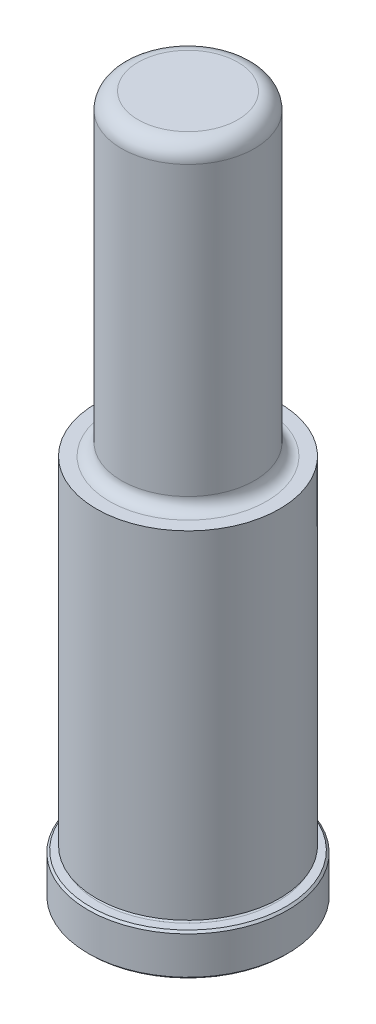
ISO-10303-21;
HEADER;
FILE_DESCRIPTION(('STEP AP214'),'2;1');
FILE_NAME('part.step','',(''),(''),'','','');
FILE_SCHEMA(('AUTOMOTIVE_DESIGN { 1 0 10303 214 1 1 1 1 }'));
ENDSEC;
DATA;
#1=APPLICATION_CONTEXT('core data for automotive mechanical design processes');
#2=APPLICATION_PROTOCOL_DEFINITION('international standard','automotive_design',2000,#1);
#3=PRODUCT_CONTEXT('',#1,'mechanical');
#4=PRODUCT('Part','Part','',(#3));
#5=PRODUCT_RELATED_PRODUCT_CATEGORY('part','',(#4));
#6=PRODUCT_DEFINITION_FORMATION('','',#4);
#7=PRODUCT_DEFINITION_CONTEXT('part definition',#1,'design');
#8=PRODUCT_DEFINITION('design','',#6,#7);
#9=PRODUCT_DEFINITION_SHAPE('','',#8);
#10=(LENGTH_UNIT() NAMED_UNIT(*) SI_UNIT(.MILLI.,.METRE.));
#11=(NAMED_UNIT(*) PLANE_ANGLE_UNIT() SI_UNIT($,.RADIAN.));
#12=(NAMED_UNIT(*) SI_UNIT($,.STERADIAN.) SOLID_ANGLE_UNIT());
#13=UNCERTAINTY_MEASURE_WITH_UNIT(LENGTH_MEASURE(1.E-05),#10,'distance_accuracy_value','');
#14=(GEOMETRIC_REPRESENTATION_CONTEXT(3) GLOBAL_UNCERTAINTY_ASSIGNED_CONTEXT((#13)) GLOBAL_UNIT_ASSIGNED_CONTEXT((#10,
#11,#12)) REPRESENTATION_CONTEXT('',''));
#15=CARTESIAN_POINT('',(0.,0.,0.));
#16=DIRECTION('',(0.,0.,1.));
#17=DIRECTION('',(1.,0.,0.));
#18=AXIS2_PLACEMENT_3D('',#15,#16,#17);
#19=CARTESIAN_POINT('',(0.,0.,0.));
#20=DIRECTION('',(0.,1.,0.));
#21=DIRECTION('',(0.,0.,1.));
#22=AXIS2_PLACEMENT_3D('',#19,#20,#21);
#23=PLANE('',#22);
#24=CARTESIAN_POINT('',(0.,0.,0.));
#25=DIRECTION('',(0.,1.,0.));
#26=DIRECTION('',(0.,0.,1.));
#27=AXIS2_PLACEMENT_3D('',#24,#25,#26);
#28=CIRCLE('',#27,18.669);
#29=CARTESIAN_POINT('',(0.,0.,18.669));
#30=VERTEX_POINT('',#29);
#31=EDGE_CURVE('E46',#30,#30,#28,.F.);
#32=ORIENTED_EDGE('',*,*,#31,.T.);
#33=EDGE_LOOP('',(#32));
#34=FACE_BOUND('',#33,.T.);
#35=ADVANCED_FACE('F31',(#34),#23,.F.);
#36=CARTESIAN_POINT('',(0.,0.,0.));
#37=DIRECTION('',(0.,1.,0.));
#38=DIRECTION('',(0.,0.,1.));
#39=AXIS2_PLACEMENT_3D('',#36,#37,#38);
#40=CYLINDRICAL_SURFACE('',#39,19.05);
#41=CARTESIAN_POINT('',(0.,0.380999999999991,0.));
#42=DIRECTION('',(0.,1.,0.));
#43=DIRECTION('',(0.,0.,1.));
#44=AXIS2_PLACEMENT_3D('',#41,#42,#43);
#45=CIRCLE('',#44,19.05);
#46=CARTESIAN_POINT('',(0.,0.380999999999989,19.05));
#47=VERTEX_POINT('',#46);
#48=EDGE_CURVE('E51',#47,#47,#45,.T.);
#49=ORIENTED_EDGE('',*,*,#48,.T.);
#50=EDGE_LOOP('',(#49));
#51=FACE_BOUND('',#50,.T.);
#52=CARTESIAN_POINT('',(0.,7.54380000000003,0.));
#53=DIRECTION('',(0.,-1.,0.));
#54=DIRECTION('',(0.,0.,-1.));
#55=AXIS2_PLACEMENT_3D('',#52,#53,#54);
#56=CIRCLE('',#55,19.05);
#57=CARTESIAN_POINT('',(0.,7.54380000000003,-19.05));
#58=VERTEX_POINT('',#57);
#59=EDGE_CURVE('E54',#58,#58,#56,.T.);
#60=ORIENTED_EDGE('',*,*,#59,.T.);
#61=EDGE_LOOP('',(#60));
#62=FACE_BOUND('',#61,.T.);
#63=ADVANCED_FACE('F110',(#51,#62),#40,.T.);
#64=CARTESIAN_POINT('',(0.,7.9248,-19.05));
#65=DIRECTION('',(0.,-1.,0.));
#66=DIRECTION('',(0.,0.,-1.));
#67=AXIS2_PLACEMENT_3D('',#64,#65,#66);
#68=PLANE('',#67);
#69=CARTESIAN_POINT('',(0.,7.9248,0.));
#70=DIRECTION('',(0.,-1.,0.));
#71=DIRECTION('',(0.,0.,-1.));
#72=AXIS2_PLACEMENT_3D('',#69,#70,#71);
#73=CIRCLE('',#72,18.669);
#74=CARTESIAN_POINT('',(0.,7.9248,-18.669));
#75=VERTEX_POINT('',#74);
#76=EDGE_CURVE('E42',#75,#75,#73,.F.);
#77=ORIENTED_EDGE('',*,*,#76,.T.);
#78=EDGE_LOOP('',(#77));
#79=FACE_BOUND('',#78,.T.);
#80=CARTESIAN_POINT('',(0.,7.9248,0.));
#81=DIRECTION('',(0.,1.,0.));
#82=DIRECTION('',(0.,0.,1.));
#83=AXIS2_PLACEMENT_3D('',#80,#81,#82);
#84=CIRCLE('',#83,17.0688);
#85=CARTESIAN_POINT('',(0.,7.92479999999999,17.0688));
#86=VERTEX_POINT('',#85);
#87=EDGE_CURVE('E57',#86,#86,#84,.T.);
#88=ORIENTED_EDGE('',*,*,#87,.F.);
#89=EDGE_LOOP('',(#88));
#90=FACE_BOUND('',#89,.T.);
#91=ADVANCED_FACE('F105',(#79,#90),#68,.F.);
#92=CARTESIAN_POINT('',(0.,8.3058,0.));
#93=DIRECTION('',(0.,1.,0.));
#94=DIRECTION('',(0.,0.,1.));
#95=AXIS2_PLACEMENT_3D('',#92,#93,#94);
#96=TOROIDAL_SURFACE('',#95,17.0688,0.381000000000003);
#97=CARTESIAN_POINT('',(0.,8.6868,0.));
#98=DIRECTION('',(0.,1.,0.));
#99=DIRECTION('',(0.,0.,1.));
#100=AXIS2_PLACEMENT_3D('',#97,#98,#99);
#101=CIRCLE('',#100,17.0688);
#102=CARTESIAN_POINT('',(0.,8.6868,17.0688));
#103=VERTEX_POINT('',#102);
#104=EDGE_CURVE('E60',#103,#103,#101,.T.);
#105=ORIENTED_EDGE('',*,*,#104,.F.);
#106=EDGE_LOOP('',(#105));
#107=FACE_BOUND('',#106,.T.);
#108=ORIENTED_EDGE('',*,*,#87,.T.);
#109=EDGE_LOOP('',(#108));
#110=FACE_BOUND('',#109,.T.);
#111=ADVANCED_FACE('F99',(#107,#110),#96,.F.);
#112=CARTESIAN_POINT('',(0.,8.6868,-17.0688));
#113=DIRECTION('',(0.,1.,0.));
#114=DIRECTION('',(0.,0.,1.));
#115=AXIS2_PLACEMENT_3D('',#112,#113,#114);
#116=PLANE('',#115);
#117=CARTESIAN_POINT('',(0.,8.6868,0.));
#118=DIRECTION('',(0.,1.,0.));
#119=DIRECTION('',(0.,0.,1.));
#120=AXIS2_PLACEMENT_3D('',#117,#118,#119);
#121=CIRCLE('',#120,17.4752);
#122=CARTESIAN_POINT('',(0.,8.6868,17.4752));
#123=VERTEX_POINT('',#122);
#124=EDGE_CURVE('E63',#123,#123,#121,.T.);
#125=ORIENTED_EDGE('',*,*,#124,.F.);
#126=EDGE_LOOP('',(#125));
#127=FACE_BOUND('',#126,.T.);
#128=ORIENTED_EDGE('',*,*,#104,.T.);
#129=EDGE_LOOP('',(#128));
#130=FACE_BOUND('',#129,.T.);
#131=ADVANCED_FACE('F93',(#127,#130),#116,.F.);
#132=CARTESIAN_POINT('',(0.,0.,0.));
#133=DIRECTION('',(0.,1.,0.));
#134=DIRECTION('',(0.,0.,1.));
#135=AXIS2_PLACEMENT_3D('',#132,#133,#134);
#136=CYLINDRICAL_SURFACE('',#135,17.4752);
#137=CARTESIAN_POINT('',(0.,73.025,0.));
#138=DIRECTION('',(0.,1.,0.));
#139=DIRECTION('',(0.,0.,1.));
#140=AXIS2_PLACEMENT_3D('',#137,#138,#139);
#141=CIRCLE('',#140,17.4752);
#142=CARTESIAN_POINT('',(0.,73.025,17.4752));
#143=VERTEX_POINT('',#142);
#144=EDGE_CURVE('E66',#143,#143,#141,.T.);
#145=ORIENTED_EDGE('',*,*,#144,.F.);
#146=EDGE_LOOP('',(#145));
#147=FACE_BOUND('',#146,.T.);
#148=ORIENTED_EDGE('',*,*,#124,.T.);
#149=EDGE_LOOP('',(#148));
#150=FACE_BOUND('',#149,.T.);
#151=ADVANCED_FACE('F87',(#147,#150),#136,.T.);
#152=CARTESIAN_POINT('',(0.,73.025,-17.4752));
#153=DIRECTION('',(0.,-1.,0.));
#154=DIRECTION('',(0.,0.,-1.));
#155=AXIS2_PLACEMENT_3D('',#152,#153,#154);
#156=PLANE('',#155);
#157=CARTESIAN_POINT('',(0.,73.025,0.));
#158=DIRECTION('',(0.,1.,0.));
#159=DIRECTION('',(0.,0.,1.));
#160=AXIS2_PLACEMENT_3D('',#157,#158,#159);
#161=CIRCLE('',#160,14.9733);
#162=CARTESIAN_POINT('',(0.,73.025,14.9733));
#163=VERTEX_POINT('',#162);
#164=EDGE_CURVE('E69',#163,#163,#161,.T.);
#165=ORIENTED_EDGE('',*,*,#164,.F.);
#166=EDGE_LOOP('',(#165));
#167=FACE_BOUND('',#166,.T.);
#168=ORIENTED_EDGE('',*,*,#144,.T.);
#169=EDGE_LOOP('',(#168));
#170=FACE_BOUND('',#169,.T.);
#171=ADVANCED_FACE('F81',(#167,#170),#156,.F.);
#172=CARTESIAN_POINT('',(0.,75.311,0.));
#173=DIRECTION('',(0.,1.,0.));
#174=DIRECTION('',(0.,0.,1.));
#175=AXIS2_PLACEMENT_3D('',#172,#173,#174);
#176=TOROIDAL_SURFACE('',#175,14.9733,2.286);
#177=CARTESIAN_POINT('',(0.,75.311,0.));
#178=DIRECTION('',(0.,1.,0.));
#179=DIRECTION('',(0.,0.,1.));
#180=AXIS2_PLACEMENT_3D('',#177,#178,#179);
#181=CIRCLE('',#180,12.6873);
#182=CARTESIAN_POINT('',(0.,75.311,12.6873));
#183=VERTEX_POINT('',#182);
#184=EDGE_CURVE('E72',#183,#183,#181,.T.);
#185=ORIENTED_EDGE('',*,*,#184,.F.);
#186=EDGE_LOOP('',(#185));
#187=FACE_BOUND('',#186,.T.);
#188=ORIENTED_EDGE('',*,*,#164,.T.);
#189=EDGE_LOOP('',(#188));
#190=FACE_BOUND('',#189,.T.);
#191=ADVANCED_FACE('F78',(#187,#190),#176,.F.);
#192=CARTESIAN_POINT('',(0.,0.,0.));
#193=DIRECTION('',(0.,1.,0.));
#194=DIRECTION('',(0.,0.,1.));
#195=AXIS2_PLACEMENT_3D('',#192,#193,#194);
#196=CYLINDRICAL_SURFACE('',#195,12.6873);
#197=CARTESIAN_POINT('',(0.,130.175,0.));
#198=DIRECTION('',(0.,-1.,0.));
#199=DIRECTION('',(0.,0.,-1.));
#200=AXIS2_PLACEMENT_3D('',#197,#198,#199);
#201=CIRCLE('',#200,12.6873);
#202=CARTESIAN_POINT('',(0.,130.175,-12.6873));
#203=VERTEX_POINT('',#202);
#204=EDGE_CURVE('E10',#203,#203,#201,.T.);
#205=ORIENTED_EDGE('',*,*,#204,.T.);
#206=EDGE_LOOP('',(#205));
#207=FACE_BOUND('',#206,.T.);
#208=ORIENTED_EDGE('',*,*,#184,.T.);
#209=EDGE_LOOP('',(#208));
#210=FACE_BOUND('',#209,.T.);
#211=ADVANCED_FACE('F76',(#207,#210),#196,.T.);
#212=CARTESIAN_POINT('',(0.,133.35,-12.6873));
#213=DIRECTION('',(0.,-1.,0.));
#214=DIRECTION('',(0.,0.,-1.));
#215=AXIS2_PLACEMENT_3D('',#212,#213,#214);
#216=PLANE('',#215);
#217=CARTESIAN_POINT('',(0.,133.35,0.));
#218=DIRECTION('',(0.,-1.,0.));
#219=DIRECTION('',(0.,0.,-1.));
#220=AXIS2_PLACEMENT_3D('',#217,#218,#219);
#221=CIRCLE('',#220,9.51230000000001);
#222=CARTESIAN_POINT('',(0.,133.35,-9.51229999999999));
#223=VERTEX_POINT('',#222);
#224=EDGE_CURVE('E38',#223,#223,#221,.F.);
#225=ORIENTED_EDGE('',*,*,#224,.T.);
#226=EDGE_LOOP('',(#225));
#227=FACE_BOUND('',#226,.T.);
#228=ADVANCED_FACE('F127',(#227),#216,.F.);
#229=CARTESIAN_POINT('',(0.,0.380999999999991,0.));
#230=DIRECTION('',(0.,1.,0.));
#231=DIRECTION('',(0.,0.,1.));
#232=AXIS2_PLACEMENT_3D('',#229,#230,#231);
#233=CONICAL_SURFACE('',#232,19.05,0.785398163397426);
#234=CARTESIAN_POINT('',(0.,0.,18.669));
#235=CARTESIAN_POINT('',(0.,0.00396874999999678,18.67296875));
#236=CARTESIAN_POINT('',(0.,0.0079374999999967,18.6769375));
#237=CARTESIAN_POINT('',(0.,0.0158749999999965,18.684875));
#238=CARTESIAN_POINT('',(0.,0.0198437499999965,18.68884375));
#239=CARTESIAN_POINT('',(0.,0.0277812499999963,18.69678125));
#240=CARTESIAN_POINT('',(0.,0.0317499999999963,18.70075));
#241=CARTESIAN_POINT('',(0.,0.039687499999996,18.7086875));
#242=CARTESIAN_POINT('',(0.,0.0436562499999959,18.71265625));
#243=CARTESIAN_POINT('',(0.,0.0515937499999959,18.72059375));
#244=CARTESIAN_POINT('',(0.,0.0555624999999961,18.7245625));
#245=CARTESIAN_POINT('',(0.,0.0634999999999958,18.7325));
#246=CARTESIAN_POINT('',(0.,0.0674687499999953,18.73646875));
#247=CARTESIAN_POINT('',(0.,0.075406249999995,18.74440625));
#248=CARTESIAN_POINT('',(0.,0.0793749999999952,18.748375));
#249=CARTESIAN_POINT('',(0.,0.0873124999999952,18.7563125));
#250=CARTESIAN_POINT('',(0.,0.0912812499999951,18.76028125));
#251=CARTESIAN_POINT('',(0.,0.0992187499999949,18.76821875));
#252=CARTESIAN_POINT('',(0.,0.103187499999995,18.7721875));
#253=CARTESIAN_POINT('',(0.,0.111124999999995,18.780125));
#254=CARTESIAN_POINT('',(0.,0.115093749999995,18.78409375));
#255=CARTESIAN_POINT('',(0.,0.123031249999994,18.79203125));
#256=CARTESIAN_POINT('',(0.,0.126999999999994,18.796));
#257=CARTESIAN_POINT('',(0.,0.134937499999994,18.8039375));
#258=CARTESIAN_POINT('',(0.,0.138906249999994,18.80790625));
#259=CARTESIAN_POINT('',(0.,0.146843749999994,18.81584375));
#260=CARTESIAN_POINT('',(0.,0.150812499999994,18.8198125));
#261=CARTESIAN_POINT('',(0.,0.158749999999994,18.82775));
#262=CARTESIAN_POINT('',(0.,0.162718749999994,18.83171875));
#263=CARTESIAN_POINT('',(0.,0.170656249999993,18.83965625));
#264=CARTESIAN_POINT('',(0.,0.174624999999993,18.843625));
#265=CARTESIAN_POINT('',(0.,0.182562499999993,18.8515625));
#266=CARTESIAN_POINT('',(0.,0.186531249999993,18.85553125));
#267=CARTESIAN_POINT('',(0.,0.194468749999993,18.86346875));
#268=CARTESIAN_POINT('',(0.,0.198437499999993,18.8674375));
#269=CARTESIAN_POINT('',(0.,0.206374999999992,18.875375));
#270=CARTESIAN_POINT('',(0.,0.210343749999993,18.87934375));
#271=CARTESIAN_POINT('',(0.,0.218281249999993,18.88728125));
#272=CARTESIAN_POINT('',(0.,0.222249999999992,18.89125));
#273=CARTESIAN_POINT('',(0.,0.230187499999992,18.8991875));
#274=CARTESIAN_POINT('',(0.,0.234156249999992,18.90315625));
#275=CARTESIAN_POINT('',(0.,0.242093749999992,18.91109375));
#276=CARTESIAN_POINT('',(0.,0.246062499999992,18.9150625));
#277=CARTESIAN_POINT('',(0.,0.253999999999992,18.923));
#278=CARTESIAN_POINT('',(0.,0.257968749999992,18.92696875));
#279=CARTESIAN_POINT('',(0.,0.265906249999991,18.93490625));
#280=CARTESIAN_POINT('',(0.,0.269874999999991,18.938875));
#281=CARTESIAN_POINT('',(0.,0.277812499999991,18.9468125));
#282=CARTESIAN_POINT('',(0.,0.281781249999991,18.95078125));
#283=CARTESIAN_POINT('',(0.,0.289718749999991,18.95871875));
#284=CARTESIAN_POINT('',(0.,0.293687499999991,18.9626875));
#285=CARTESIAN_POINT('',(0.,0.301624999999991,18.970625));
#286=CARTESIAN_POINT('',(0.,0.305593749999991,18.97459375));
#287=CARTESIAN_POINT('',(0.,0.313531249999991,18.98253125));
#288=CARTESIAN_POINT('',(0.,0.31749999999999,18.9865));
#289=CARTESIAN_POINT('',(0.,0.32543749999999,18.9944375));
#290=CARTESIAN_POINT('',(0.,0.32940624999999,18.99840625));
#291=CARTESIAN_POINT('',(0.,0.33734374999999,19.00634375));
#292=CARTESIAN_POINT('',(0.,0.34131249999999,19.0103125));
#293=CARTESIAN_POINT('',(0.,0.34924999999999,19.01825));
#294=CARTESIAN_POINT('',(0.,0.35321874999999,19.02221875));
#295=CARTESIAN_POINT('',(0.,0.36115624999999,19.03015625));
#296=CARTESIAN_POINT('',(0.,0.365124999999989,19.034125));
#297=CARTESIAN_POINT('',(0.,0.373062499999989,19.0420625));
#298=CARTESIAN_POINT('',(0.,0.377031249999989,19.04603125));
#299=CARTESIAN_POINT('',(0.,0.380999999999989,19.05));
#300=B_SPLINE_CURVE_WITH_KNOTS('',3,(#234,#235,#236,#237,#238,#239,#240,#241,#242,#243,#244,
#245,#246,#247,#248,#249,#250,#251,#252,#253,#254,#255,#256,#257,#258,#259,#260,#261,#262,#263,
#264,#265,#266,#267,#268,#269,#270,#271,#272,#273,#274,#275,#276,#277,#278,#279,#280,#281,#282,
#283,#284,#285,#286,#287,#288,#289,#290,#291,#292,#293,#294,#295,#296,#297,#298,#299),
.UNSPECIFIED.,.F.,.F.,(4,2,2,2,2,2,2,2,2,2,2,2,2,2,2,2,2,2,2,2,2,2,2,2,2,2,2,2,2,2,2,2,4),(0.,
0.0168379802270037,0.0336759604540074,0.0505139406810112,0.0673519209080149,0.0841899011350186,
0.101027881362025,0.117865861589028,0.134703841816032,0.151541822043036,0.16837980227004,
0.185217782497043,0.202055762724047,0.218893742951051,0.235731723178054,0.252569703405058,
0.269407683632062,0.286245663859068,0.303083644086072,0.319921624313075,0.336759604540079,
0.353597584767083,0.370435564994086,0.38727354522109,0.404111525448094,0.420949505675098,
0.437787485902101,0.454625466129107,0.471463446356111,0.488301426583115,0.505139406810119,
0.521977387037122,0.538815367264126),.UNSPECIFIED.);
#301=EDGE_CURVE('BSEAM124',#30,#47,#300,.T.);
#302=ORIENTED_EDGE('',*,*,#31,.F.);
#303=ORIENTED_EDGE('',*,*,#48,.F.);
#304=ORIENTED_EDGE('',*,*,#301,.T.);
#305=ORIENTED_EDGE('',*,*,#301,.F.);
#306=EDGE_LOOP('',(#302,#304,#303,#305));
#307=FACE_BOUND('',#306,.T.);
#308=ADVANCED_FACE('F124',(#307),#233,.T.);
#309=CARTESIAN_POINT('',(0.,7.9248,0.));
#310=DIRECTION('',(0.,-1.,0.));
#311=DIRECTION('',(0.,0.,-1.));
#312=AXIS2_PLACEMENT_3D('',#309,#310,#311);
#313=CONICAL_SURFACE('',#312,18.669,0.785398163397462);
#314=ORIENTED_EDGE('',*,*,#59,.F.);
#315=EDGE_LOOP('',(#314));
#316=FACE_BOUND('',#315,.T.);
#317=ORIENTED_EDGE('',*,*,#76,.F.);
#318=EDGE_LOOP('',(#317));
#319=FACE_BOUND('',#318,.T.);
#320=ADVANCED_FACE('F126',(#316,#319),#313,.T.);
#321=CARTESIAN_POINT('',(0.,130.175,0.));
#322=DIRECTION('',(0.,-1.,0.));
#323=DIRECTION('',(0.,0.,-1.));
#324=AXIS2_PLACEMENT_3D('',#321,#322,#323);
#325=TOROIDAL_SURFACE('',#324,9.51230000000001,3.175);
#326=ORIENTED_EDGE('',*,*,#204,.F.);
#327=EDGE_LOOP('',(#326));
#328=FACE_BOUND('',#327,.T.);
#329=ORIENTED_EDGE('',*,*,#224,.F.);
#330=EDGE_LOOP('',(#329));
#331=FACE_BOUND('',#330,.T.);
#332=ADVANCED_FACE('F33',(#328,#331),#325,.T.);
#333=CLOSED_SHELL('',(#35,#63,#91,#111,#131,#151,#171,#191,#211,#228,#308,#320,#332));
#334=MANIFOLD_SOLID_BREP('B2',#333);
#335=ADVANCED_BREP_SHAPE_REPRESENTATION('',(#18,#334),#14);
#336=SHAPE_DEFINITION_REPRESENTATION(#9,#335);
ENDSEC;
END-ISO-10303-21;
